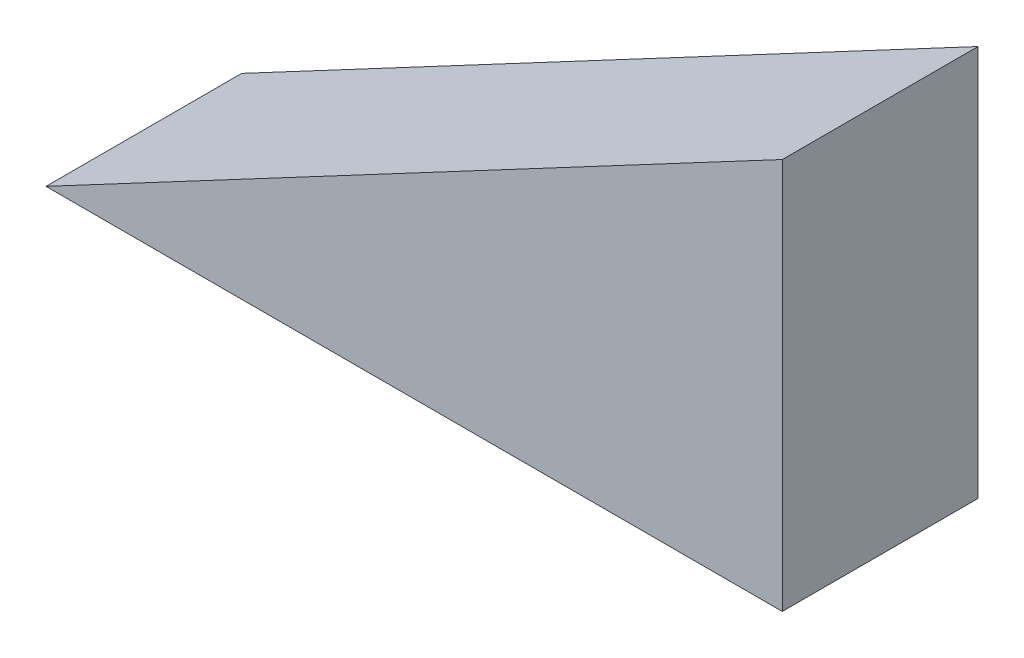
ISO-10303-21;
HEADER;
FILE_DESCRIPTION(('STEP AP214'),'2;1');
FILE_NAME('part.step','',(''),(''),'','','');
FILE_SCHEMA(('AUTOMOTIVE_DESIGN { 1 0 10303 214 1 1 1 1 }'));
ENDSEC;
DATA;
#1=APPLICATION_CONTEXT('core data for automotive mechanical design processes');
#2=APPLICATION_PROTOCOL_DEFINITION('international standard','automotive_design',2000,#1);
#3=PRODUCT_CONTEXT('',#1,'mechanical');
#4=PRODUCT('Part','Part','',(#3));
#5=PRODUCT_RELATED_PRODUCT_CATEGORY('part','',(#4));
#6=PRODUCT_DEFINITION_FORMATION('','',#4);
#7=PRODUCT_DEFINITION_CONTEXT('part definition',#1,'design');
#8=PRODUCT_DEFINITION('design','',#6,#7);
#9=PRODUCT_DEFINITION_SHAPE('','',#8);
#10=(LENGTH_UNIT() NAMED_UNIT(*) SI_UNIT(.MILLI.,.METRE.));
#11=(NAMED_UNIT(*) PLANE_ANGLE_UNIT() SI_UNIT($,.RADIAN.));
#12=(NAMED_UNIT(*) SI_UNIT($,.STERADIAN.) SOLID_ANGLE_UNIT());
#13=UNCERTAINTY_MEASURE_WITH_UNIT(LENGTH_MEASURE(1.E-05),#10,'distance_accuracy_value','');
#14=(GEOMETRIC_REPRESENTATION_CONTEXT(3) GLOBAL_UNCERTAINTY_ASSIGNED_CONTEXT((#13)) GLOBAL_UNIT_ASSIGNED_CONTEXT((#10,
#11,#12)) REPRESENTATION_CONTEXT('',''));
#15=CARTESIAN_POINT('',(0.,0.,0.));
#16=DIRECTION('',(0.,0.,1.));
#17=DIRECTION('',(1.,0.,0.));
#18=AXIS2_PLACEMENT_3D('',#15,#16,#17);
#19=CARTESIAN_POINT('',(0.,0.,17.19));
#20=DIRECTION('',(0.,0.,-1.));
#21=DIRECTION('',(0.,-1.,0.));
#22=AXIS2_PLACEMENT_3D('',#19,#20,#21);
#23=PLANE('',#22);
#24=DIRECTION('',(0.,1.,0.));
#25=VECTOR('',#24,1.);
#26=CARTESIAN_POINT('',(49.425,-4.,17.19));
#27=LINE('',#26,#25);
#28=CARTESIAN_POINT('',(49.425,-4.,17.19));
#29=VERTEX_POINT('',#28);
#30=CARTESIAN_POINT('',(49.425,0.,17.19));
#31=VERTEX_POINT('',#30);
#32=EDGE_CURVE('E58',#29,#31,#27,.T.);
#33=ORIENTED_EDGE('',*,*,#32,.T.);
#34=DIRECTION('',(-0.883001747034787,-0.469369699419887,0.));
#35=VECTOR('',#34,1.);
#36=CARTESIAN_POINT('',(41.9,-4.,17.19));
#37=LINE('',#36,#35);
#38=CARTESIAN_POINT('',(41.9,-4.,17.19));
#39=VERTEX_POINT('',#38);
#40=EDGE_CURVE('E24',#31,#39,#37,.T.);
#41=ORIENTED_EDGE('',*,*,#40,.T.);
#42=DIRECTION('',(1.,0.,0.));
#43=VECTOR('',#42,1.);
#44=CARTESIAN_POINT('',(41.9,-4.,17.19));
#45=LINE('',#44,#43);
#46=EDGE_CURVE('E55',#39,#29,#45,.T.);
#47=ORIENTED_EDGE('',*,*,#46,.T.);
#48=EDGE_LOOP('',(#33,#41,#47));
#49=FACE_BOUND('',#48,.T.);
#50=ADVANCED_FACE('F15',(#49),#23,.F.);
#51=CARTESIAN_POINT('',(0.,0.,15.19));
#52=DIRECTION('',(0.,0.,-1.));
#53=DIRECTION('',(0.,-1.,0.));
#54=AXIS2_PLACEMENT_3D('',#51,#52,#53);
#55=PLANE('',#54);
#56=DIRECTION('',(0.,1.,0.));
#57=VECTOR('',#56,1.);
#58=CARTESIAN_POINT('',(49.425,-4.,15.19));
#59=LINE('',#58,#57);
#60=CARTESIAN_POINT('',(49.425,-4.,15.19));
#61=VERTEX_POINT('',#60);
#62=CARTESIAN_POINT('',(49.425,0.,15.19));
#63=VERTEX_POINT('',#62);
#64=EDGE_CURVE('E73',#61,#63,#59,.T.);
#65=ORIENTED_EDGE('',*,*,#64,.F.);
#66=DIRECTION('',(1.,0.,0.));
#67=VECTOR('',#66,1.);
#68=CARTESIAN_POINT('',(41.9,-4.,15.19));
#69=LINE('',#68,#67);
#70=CARTESIAN_POINT('',(41.9,-4.,15.19));
#71=VERTEX_POINT('',#70);
#72=EDGE_CURVE('E68',#71,#61,#69,.T.);
#73=ORIENTED_EDGE('',*,*,#72,.F.);
#74=DIRECTION('',(-0.883001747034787,-0.469369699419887,0.));
#75=VECTOR('',#74,1.);
#76=CARTESIAN_POINT('',(41.9,-4.,15.19));
#77=LINE('',#76,#75);
#78=EDGE_CURVE('E9',#63,#71,#77,.T.);
#79=ORIENTED_EDGE('',*,*,#78,.F.);
#80=EDGE_LOOP('',(#65,#73,#79));
#81=FACE_BOUND('',#80,.T.);
#82=ADVANCED_FACE('F95',(#81),#55,.T.);
#83=CARTESIAN_POINT('',(41.9,-4.,15.19));
#84=DIRECTION('',(-0.469369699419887,0.883001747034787,0.));
#85=DIRECTION('',(0.,0.,1.));
#86=AXIS2_PLACEMENT_3D('',#83,#84,#85);
#87=PLANE('',#86);
#88=ORIENTED_EDGE('',*,*,#40,.F.);
#89=DIRECTION('',(0.,0.,1.));
#90=VECTOR('',#89,1.);
#91=CARTESIAN_POINT('',(49.425,0.,15.19));
#92=LINE('',#91,#90);
#93=EDGE_CURVE('E63',#63,#31,#92,.T.);
#94=ORIENTED_EDGE('',*,*,#93,.F.);
#95=ORIENTED_EDGE('',*,*,#78,.T.);
#96=DIRECTION('',(0.,0.,1.));
#97=VECTOR('',#96,1.);
#98=CARTESIAN_POINT('',(41.9,-4.,15.19));
#99=LINE('',#98,#97);
#100=EDGE_CURVE('E62',#71,#39,#99,.T.);
#101=ORIENTED_EDGE('',*,*,#100,.T.);
#102=EDGE_LOOP('',(#88,#94,#95,#101));
#103=FACE_BOUND('',#102,.T.);
#104=ADVANCED_FACE('F100',(#103),#87,.T.);
#105=CARTESIAN_POINT('',(41.9,-4.,15.19));
#106=DIRECTION('',(0.,-1.,0.));
#107=DIRECTION('',(-1.,0.,0.));
#108=AXIS2_PLACEMENT_3D('',#105,#106,#107);
#109=PLANE('',#108);
#110=ORIENTED_EDGE('',*,*,#46,.F.);
#111=ORIENTED_EDGE('',*,*,#100,.F.);
#112=ORIENTED_EDGE('',*,*,#72,.T.);
#113=DIRECTION('',(0.,0.,1.));
#114=VECTOR('',#113,1.);
#115=CARTESIAN_POINT('',(49.425,-4.,15.19));
#116=LINE('',#115,#114);
#117=EDGE_CURVE('E66',#61,#29,#116,.T.);
#118=ORIENTED_EDGE('',*,*,#117,.T.);
#119=EDGE_LOOP('',(#110,#111,#112,#118));
#120=FACE_BOUND('',#119,.T.);
#121=ADVANCED_FACE('F67',(#120),#109,.T.);
#122=CARTESIAN_POINT('',(49.425,-4.,15.19));
#123=DIRECTION('',(1.,0.,0.));
#124=DIRECTION('',(0.,1.,0.));
#125=AXIS2_PLACEMENT_3D('',#122,#123,#124);
#126=PLANE('',#125);
#127=ORIENTED_EDGE('',*,*,#32,.F.);
#128=ORIENTED_EDGE('',*,*,#117,.F.);
#129=ORIENTED_EDGE('',*,*,#64,.T.);
#130=ORIENTED_EDGE('',*,*,#93,.T.);
#131=EDGE_LOOP('',(#127,#128,#129,#130));
#132=FACE_BOUND('',#131,.T.);
#133=ADVANCED_FACE('F76',(#132),#126,.T.);
#134=CLOSED_SHELL('',(#50,#82,#104,#121,#133));
#135=MANIFOLD_SOLID_BREP('B1',#134);
#136=ADVANCED_BREP_SHAPE_REPRESENTATION('',(#18,#135),#14);
#137=SHAPE_DEFINITION_REPRESENTATION(#9,#136);
ENDSEC;
END-ISO-10303-21;
